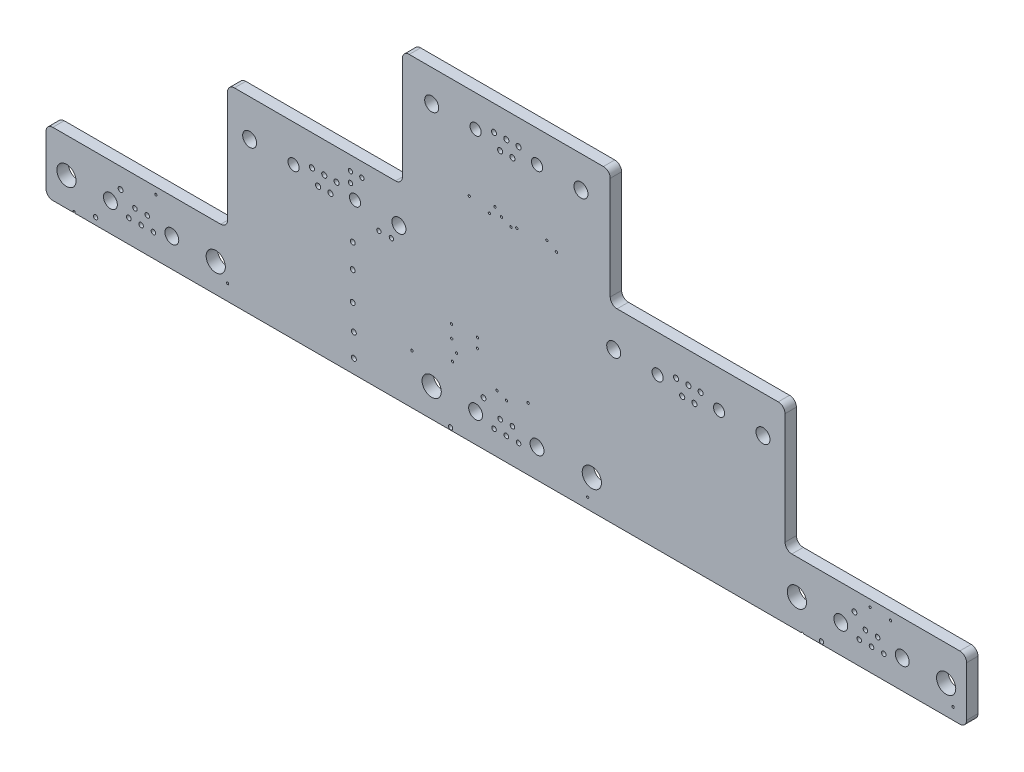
from build123d import *

# Parameters (mm, degrees)
MODEL_R             = 1.2446
MODEL_R_2           = 0.5715
MODEL_R_3           = 0.4826
MODEL_R_4           = 1.5621
MODEL_R_5           = 0.508
MODEL_R_6           = 1.5494
MODEL_R_7           = 2.1463
MODEL_R_8           = 0.5461
MODEL_R_9           = 0.254
BOSS_EXTRUDE1_DEPTH = 2.54
SKETCH3_W           = 238.966305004
SKETCH3_H           = 119.483152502
CUT_EXTRUDE2_DEPTH  = 225.1506467
FILLET1_R           = 1.524


with BuildPart() as part:
    # Model → Boss-Extrude1 (new body)
    with BuildSketch(Plane.XY):
        Polygon((0, 0), (208.28, 0), (208.28, 55.2196), (167.386, 55.2196), (167.386, 82.804), (40.6146, 82.804), (40.6146, 55.0672), (0, 55.0672), align=None)
        with Locations((110.998, 68.311845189)):
            Circle(MODEL_R, mode=Mode.SUBTRACT)
        with Locations((101.3968, 69.734245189)):
            Circle(MODEL_R_2, mode=Mode.SUBTRACT)
        with Locations((151.638, 41.133845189)):
            Circle(MODEL_R, mode=Mode.SUBTRACT)
        with Locations((142.0368, 42.556245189)):
            Circle(MODEL_R_2, mode=Mode.SUBTRACT)
        with Locations((144.78, 42.556245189)):
            Circle(MODEL_R_2, mode=Mode.SUBTRACT)
        with Locations((12.446, 8.89)):
            Circle(MODEL_R_3, mode=Mode.SUBTRACT)
        with Locations((91.694, 7.874)):
            Circle(MODEL_R_3, mode=Mode.SUBTRACT)
        with Locations((174.498, 7.874)):
            Circle(MODEL_R_3, mode=Mode.SUBTRACT)
        with Locations((78.994, 52.324)):
            Circle(MODEL_R_3, mode=Mode.SUBTRACT)
        with Locations((76.454, 52.324)):
            Circle(MODEL_R_3, mode=Mode.SUBTRACT)
        with Locations((74.168, 52.324)):
            Circle(MODEL_R_3, mode=Mode.SUBTRACT)
        with Locations((104.14, 69.734245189)):
            Circle(MODEL_R_2, mode=Mode.SUBTRACT)
        with Locations((106.8832, 69.734245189)):
            Circle(MODEL_R_2, mode=Mode.SUBTRACT)
        with Locations((75.692, 37.846)):
            Circle(MODEL_R_3, mode=Mode.SUBTRACT)
        with Locations((78.486, 37.846)):
            Circle(MODEL_R_3, mode=Mode.SUBTRACT)
        with Locations((69.342, 46.228)):
            Circle(MODEL_R_3, mode=Mode.SUBTRACT)
        with Locations((69.342, 43.942)):
            Circle(MODEL_R_3, mode=Mode.SUBTRACT)
        with Locations((71.882, 46.228)):
            Circle(MODEL_R_3, mode=Mode.SUBTRACT)
        with Locations((102.7684, 66.889445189)):
            Circle(MODEL_R_2, mode=Mode.SUBTRACT)
        with Locations((105.5116, 66.889445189)):
            Circle(MODEL_R_2, mode=Mode.SUBTRACT)
        with Locations((147.5232, 42.556245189)):
            Circle(MODEL_R_2, mode=Mode.SUBTRACT)
        with Locations((143.4084, 39.711445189)):
            Circle(MODEL_R_2, mode=Mode.SUBTRACT)
        with Locations((198.882, 6.858)):
            Circle(MODEL_R_3, mode=Mode.SUBTRACT)
        with Locations((201.168, 6.858)):
            Circle(MODEL_R_3, mode=Mode.SUBTRACT)
        with Locations((146.1516, 39.711445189)):
            Circle(MODEL_R_2, mode=Mode.SUBTRACT)
        with Locations((137.922, 41.133845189)):
            Circle(MODEL_R, mode=Mode.SUBTRACT)
        with Locations((37.084, 6.604)):
            Circle(MODEL_R_3, mode=Mode.SUBTRACT)
        with Locations((39.116, 6.604)):
            Circle(MODEL_R_3, mode=Mode.SUBTRACT)
        with Locations((116.84, 6.858)):
            Circle(MODEL_R_3, mode=Mode.SUBTRACT)
        with Locations((119.126, 6.858)):
            Circle(MODEL_R_3, mode=Mode.SUBTRACT)
        with Locations((161.4424, 41.133845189)):
            Circle(MODEL_R_4, mode=Mode.SUBTRACT)
        with Locations((128.1176, 41.133845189)):
            Circle(MODEL_R_4, mode=Mode.SUBTRACT)
        with Locations(Location((80.1624, 41.133845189, 0), (0, 0, 180))):
            Circle(MODEL_R_4, mode=Mode.SUBTRACT)
        with Locations(Location((46.8376, 41.133845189, 0), (0, 0, 180))):
            Circle(MODEL_R_4, mode=Mode.SUBTRACT)
        with Locations(Location((70.358, 41.133845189, 0), (0, 0, 180))):
            Circle(MODEL_R, mode=Mode.SUBTRACT)
        with Locations(Location((62.1284, 39.711445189, 0), (0, 0, 180))):
            Circle(MODEL_R_2, mode=Mode.SUBTRACT)
        with Locations(Location((64.8716, 39.711445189, 0), (0, 0, 180))):
            Circle(MODEL_R_2, mode=Mode.SUBTRACT)
        with Locations(Location((60.7568, 42.556245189, 0), (0, 0, 180))):
            Circle(MODEL_R_2, mode=Mode.SUBTRACT)
        with Locations(Location((63.5, 42.556245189, 0), (0, 0, 180))):
            Circle(MODEL_R_2, mode=Mode.SUBTRACT)
        with Locations(Location((66.2432, 42.556245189, 0), (0, 0, 180))):
            Circle(MODEL_R_2, mode=Mode.SUBTRACT)
        with Locations(Location((56.642, 41.133845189, 0), (0, 0, 180))):
            Circle(MODEL_R, mode=Mode.SUBTRACT)
        with Locations((97.282, 68.311845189)):
            Circle(MODEL_R, mode=Mode.SUBTRACT)
        with Locations((120.8024, 68.311845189)):
            Circle(MODEL_R_4, mode=Mode.SUBTRACT)
        with Locations((87.4776, 68.311845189)):
            Circle(MODEL_R_4, mode=Mode.SUBTRACT)
        with Locations((23.9776, 14.986)):
            Circle(MODEL_R_5, mode=Mode.SUBTRACT)
        with Locations((21.2344, 14.986)):
            Circle(MODEL_R_5, mode=Mode.SUBTRACT)
        with Locations((25.3492, 12.446)):
            Circle(MODEL_R_5, mode=Mode.SUBTRACT)
        with Locations((22.606, 12.446)):
            Circle(MODEL_R_5, mode=Mode.SUBTRACT)
        with Locations((19.8628, 12.446)):
            Circle(MODEL_R_5, mode=Mode.SUBTRACT)
        with Locations((29.464, 13.716)):
            Circle(MODEL_R_6, mode=Mode.SUBTRACT)
        with Locations((15.748, 13.716)):
            Circle(MODEL_R_6, mode=Mode.SUBTRACT)
        with Locations((39.2684, 13.716)):
            Circle(MODEL_R_7, mode=Mode.SUBTRACT)
        with Locations((5.9436, 13.716)):
            Circle(MODEL_R_7, mode=Mode.SUBTRACT)
        with Locations((105.5116, 14.986)):
            Circle(MODEL_R_5, mode=Mode.SUBTRACT)
        with Locations((102.7684, 14.986)):
            Circle(MODEL_R_5, mode=Mode.SUBTRACT)
        with Locations((106.8832, 12.446)):
            Circle(MODEL_R_5, mode=Mode.SUBTRACT)
        with Locations((104.14, 12.446)):
            Circle(MODEL_R_5, mode=Mode.SUBTRACT)
        with Locations((101.3968, 12.446)):
            Circle(MODEL_R_5, mode=Mode.SUBTRACT)
        with Locations((110.998, 13.716)):
            Circle(MODEL_R_6, mode=Mode.SUBTRACT)
        with Locations((97.282, 13.716)):
            Circle(MODEL_R_6, mode=Mode.SUBTRACT)
        with Locations((123.233435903, 13.955845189)):
            Circle(MODEL_R_7, mode=Mode.SUBTRACT)
        with Locations((87.4776, 13.716)):
            Circle(MODEL_R_7, mode=Mode.SUBTRACT)
        with Locations((187.0456, 14.986)):
            Circle(MODEL_R_5, mode=Mode.SUBTRACT)
        with Locations((184.3024, 14.986)):
            Circle(MODEL_R_5, mode=Mode.SUBTRACT)
        with Locations((188.4172, 12.446)):
            Circle(MODEL_R_5, mode=Mode.SUBTRACT)
        with Locations((185.674, 12.446)):
            Circle(MODEL_R_5, mode=Mode.SUBTRACT)
        with Locations((182.9308, 12.446)):
            Circle(MODEL_R_5, mode=Mode.SUBTRACT)
        with Locations((192.532, 13.716)):
            Circle(MODEL_R_6, mode=Mode.SUBTRACT)
        with Locations((178.816, 13.716)):
            Circle(MODEL_R_6, mode=Mode.SUBTRACT)
        with Locations((202.3364, 13.716)):
            Circle(MODEL_R_7, mode=Mode.SUBTRACT)
        with Locations((169.0116, 13.716)):
            Circle(MODEL_R_7, mode=Mode.SUBTRACT)
        with Locations((70.104, 15.494)):
            Circle(MODEL_R_8, mode=Mode.SUBTRACT)
        with Locations((70.104, 10.414)):
            Circle(MODEL_R_8, mode=Mode.SUBTRACT)
        with Locations((69.85, 32.766)):
            Circle(MODEL_R_8, mode=Mode.SUBTRACT)
        with Locations((18.034, 17.018)):
            Circle(MODEL_R_8, mode=Mode.SUBTRACT)
        with Locations((99.06, 17.272)):
            Circle(MODEL_R_8, mode=Mode.SUBTRACT)
        with Locations((181.864, 17.272)):
            Circle(MODEL_R_8, mode=Mode.SUBTRACT)
        with Locations((69.85, 21.082)):
            Circle(MODEL_R_8, mode=Mode.SUBTRACT)
        with Locations((69.85, 27.432)):
            Circle(MODEL_R_8, mode=Mode.SUBTRACT)
        with Locations((86.868, 7.0612)):
            Circle(MODEL_R_9, mode=Mode.SUBTRACT)
        with Locations((59.5884, 51.3334)):
            Circle(MODEL_R_9, mode=Mode.SUBTRACT)
        with Locations((67.945, 80.01)):
            Circle(MODEL_R_9, mode=Mode.SUBTRACT)
        with Locations((67.945, 77.893333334)):
            Circle(MODEL_R_9, mode=Mode.SUBTRACT)
        with Locations((105.198333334, 53.34)):
            Circle(MODEL_R_9, mode=Mode.SUBTRACT)
        with Locations((170.2308, 7.3152)):
            Circle(MODEL_R_9, mode=Mode.SUBTRACT)
        with Locations((65.4304, 77.216)):
            Circle(MODEL_R_9, mode=Mode.SUBTRACT)
        with Locations((115.316, 53.594)):
            Circle(MODEL_R_9, mode=Mode.SUBTRACT)
        with Locations((100.3554, 53.594)):
            Circle(MODEL_R_9, mode=Mode.SUBTRACT)
        with Locations((109.0168, 21.2344)):
            Circle(MODEL_R_9, mode=Mode.SUBTRACT)
        with Locations((60.6552, 50.0888)):
            Circle(MODEL_R_9, mode=Mode.SUBTRACT)
        with Locations((95.8596, 54.6608)):
            Circle(MODEL_R_9, mode=Mode.SUBTRACT)
        with Locations((101.6, 55.456666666)):
            Circle(MODEL_R_9, mode=Mode.SUBTRACT)
        with Locations((185.3692, 22.7584)):
            Circle(MODEL_R_9, mode=Mode.SUBTRACT)
        with Locations((185.3692, 19.9136)):
            Circle(MODEL_R_9, mode=Mode.SUBTRACT)
        with Locations((113.190866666, 54.7878)):
            Circle(MODEL_R_9, mode=Mode.SUBTRACT)
        with Locations((103.0478, 54.2036)):
            Circle(MODEL_R_9, mode=Mode.SUBTRACT)
        with Locations((102.0572, 20.1676)):
            Circle(MODEL_R_9, mode=Mode.SUBTRACT)
        with Locations((104.1908, 19.304)):
            Circle(MODEL_R_9, mode=Mode.SUBTRACT)
        with Locations((93.0402, 22.8854)):
            Circle(MODEL_R_9, mode=Mode.SUBTRACT)
        with Locations((83.058, 18.3896)):
            Circle(MODEL_R_9, mode=Mode.SUBTRACT)
        with Locations((7.6454, 7.5184)):
            Circle(MODEL_R_9, mode=Mode.SUBTRACT)
        with Locations((25.908, 19.9644)):
            Circle(MODEL_R_9, mode=Mode.SUBTRACT)
        with Locations((189.9158, 19.6596)):
            Circle(MODEL_R_9, mode=Mode.SUBTRACT)
        with Locations((91.948, 25.146)):
            Circle(MODEL_R_9, mode=Mode.SUBTRACT)
        with Locations((97.6884, 28.2448)):
            Circle(MODEL_R_9, mode=Mode.SUBTRACT)
        with Locations((92.1258, 20.828)):
            Circle(MODEL_R_9, mode=Mode.SUBTRACT)
        with Locations((14.5542, 26.3652)):
            Circle(MODEL_R_9, mode=Mode.SUBTRACT)
        with Locations((91.9226, 27.9654)):
            Circle(MODEL_R_9, mode=Mode.SUBTRACT)
        with Locations((122.301, 9.652)):
            Circle(MODEL_R_9, mode=Mode.SUBTRACT)
        with Locations((41.91, 10.8204)):
            Circle(MODEL_R_9, mode=Mode.SUBTRACT)
        with Locations((54.5592, 54.3052)):
            Circle(MODEL_R_9, mode=Mode.SUBTRACT)
        with Locations((203.8858, 9.906)):
            Circle(MODEL_R_9, mode=Mode.SUBTRACT)
        with Locations((97.6884, 26.1366)):
            Circle(MODEL_R_9, mode=Mode.SUBTRACT)
        with Locations((137.6172, 53.4924)):
            Circle(MODEL_R_9, mode=Mode.SUBTRACT)
        with Locations((106.468333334, 53.763333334)):
            Circle(MODEL_R_9, mode=Mode.SUBTRACT)
    extrude(amount=BOSS_EXTRUDE1_DEPTH)

    # Sketch3 → Cut-Extrude2 (cut, through all)
    with BuildSketch(Plane(origin=(0, 0, 0), x_dir=(-1, 0, 0), z_dir=(0, 0, -1))):
        with Locations((-107.853868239, 48.746205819)):
            Rectangle(SKETCH3_W, SKETCH3_H)
        Polygon((-80.938025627, 75.356723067), (-80.938025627, 49.369366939), (-41.91, 49.369366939), (-41.91, 21.479243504), (-1.3716, 21.479243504), (-1.3716, 7.320269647), (-4.777582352, 7.320269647), (-203.502417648, 7.320269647), (-206.9084, 7.320269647), (-206.9084, 21.479243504), (-166.37, 21.479243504), (-166.37, 49.369366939), (-127.341974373, 49.369366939), (-127.341974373, 75.356723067), align=None, mode=Mode.SUBTRACT)
    extrude(amount=-CUT_EXTRUDE2_DEPTH, mode=Mode.SUBTRACT)

    # Fillet1
    fillet1_edges = [part.edges().sort_by_distance(p)[0] for p in [
        (80.938025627, 75.356723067, 1.27),
        (80.938025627, 49.369366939, 1.27),
        (41.91, 49.369366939, 1.27),
        (41.91, 21.479243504, 1.27),
        (1.3716, 21.479243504, 1.27),
        (1.3716, 7.320269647, 1.27),
        (206.9084, 7.320269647, 1.27),
        (206.9084, 21.479243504, 1.27),
        (166.37, 21.479243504, 1.27),
        (166.37, 49.369366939, 1.27),
        (127.341974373, 49.369366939, 1.27),
        (127.341974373, 75.356723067, 1.27),
    ]]
    fillet(fillet1_edges, radius=FILLET1_R)


solid = part.part
